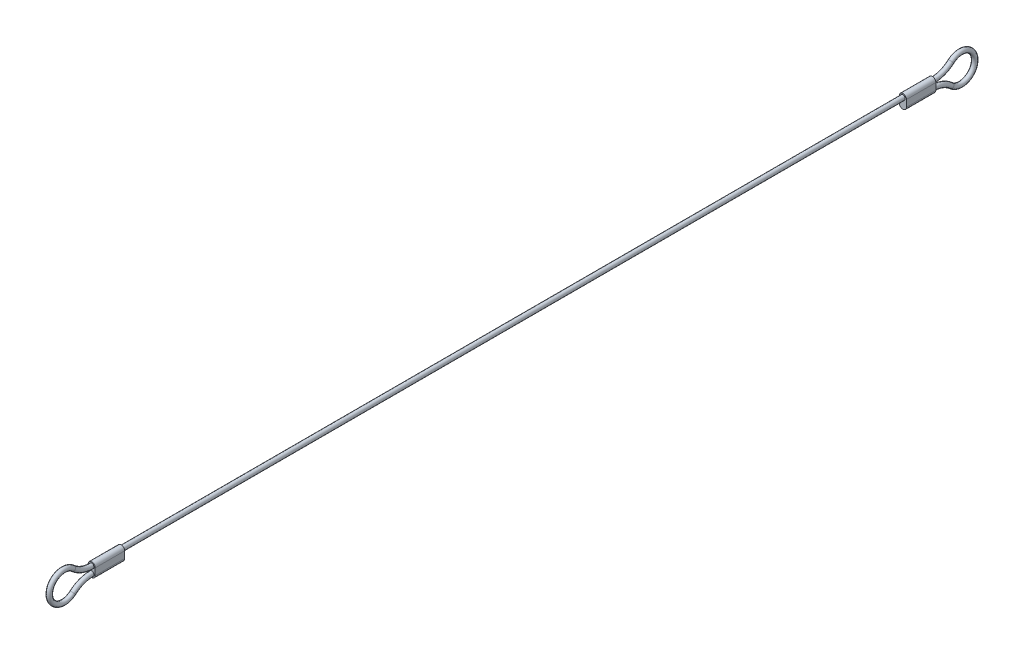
ISO-10303-21;
HEADER;
FILE_DESCRIPTION(('STEP AP214'),'2;1');
FILE_NAME('part.step','',(''),(''),'','','');
FILE_SCHEMA(('AUTOMOTIVE_DESIGN { 1 0 10303 214 1 1 1 1 }'));
ENDSEC;
DATA;
#1=APPLICATION_CONTEXT('core data for automotive mechanical design processes');
#2=APPLICATION_PROTOCOL_DEFINITION('international standard','automotive_design',2000,#1);
#3=PRODUCT_CONTEXT('',#1,'mechanical');
#4=PRODUCT('Part','Part','',(#3));
#5=PRODUCT_RELATED_PRODUCT_CATEGORY('part','',(#4));
#6=PRODUCT_DEFINITION_FORMATION('','',#4);
#7=PRODUCT_DEFINITION_CONTEXT('part definition',#1,'design');
#8=PRODUCT_DEFINITION('design','',#6,#7);
#9=PRODUCT_DEFINITION_SHAPE('','',#8);
#10=(LENGTH_UNIT() NAMED_UNIT(*) SI_UNIT(.MILLI.,.METRE.));
#11=(NAMED_UNIT(*) PLANE_ANGLE_UNIT() SI_UNIT($,.RADIAN.));
#12=(NAMED_UNIT(*) SI_UNIT($,.STERADIAN.) SOLID_ANGLE_UNIT());
#13=UNCERTAINTY_MEASURE_WITH_UNIT(LENGTH_MEASURE(1.E-05),#10,'distance_accuracy_value','');
#14=(GEOMETRIC_REPRESENTATION_CONTEXT(3) GLOBAL_UNCERTAINTY_ASSIGNED_CONTEXT((#13)) GLOBAL_UNIT_ASSIGNED_CONTEXT((#10,
#11,#12)) REPRESENTATION_CONTEXT('',''));
#15=CARTESIAN_POINT('',(0.,0.,0.));
#16=DIRECTION('',(0.,0.,1.));
#17=DIRECTION('',(1.,0.,0.));
#18=AXIS2_PLACEMENT_3D('',#15,#16,#17);
#19=CARTESIAN_POINT('',(0.,0.,-142.8));
#20=DIRECTION('',(0.,0.,1.));
#21=DIRECTION('',(1.,0.,0.));
#22=AXIS2_PLACEMENT_3D('',#19,#20,#21);
#23=CYLINDRICAL_SURFACE('',#22,0.795);
#24=CARTESIAN_POINT('',(0.,0.,-132.8));
#25=DIRECTION('',(0.,0.,1.));
#26=DIRECTION('',(0.,-1.,0.));
#27=AXIS2_PLACEMENT_3D('',#24,#25,#26);
#28=CIRCLE('',#27,0.795);
#29=CARTESIAN_POINT('',(0.,-0.795,-132.8));
#30=VERTEX_POINT('',#29);
#31=EDGE_CURVE('E11',#30,#30,#28,.F.);
#32=ORIENTED_EDGE('',*,*,#31,.F.);
#33=EDGE_LOOP('',(#32));
#34=FACE_BOUND('',#33,.T.);
#35=CARTESIAN_POINT('',(0.,0.,132.8));
#36=DIRECTION('',(0.,0.,-1.));
#37=DIRECTION('',(0.,1.,0.));
#38=AXIS2_PLACEMENT_3D('',#35,#36,#37);
#39=CIRCLE('',#38,0.795);
#40=CARTESIAN_POINT('',(0.,0.795,132.8));
#41=VERTEX_POINT('',#40);
#42=EDGE_CURVE('E51',#41,#41,#39,.F.);
#43=ORIENTED_EDGE('',*,*,#42,.F.);
#44=EDGE_LOOP('',(#43));
#45=FACE_BOUND('',#44,.T.);
#46=ADVANCED_FACE('F41',(#34,#45),#23,.T.);
#47=CARTESIAN_POINT('',(0.,0.,142.8));
#48=DIRECTION('',(0.,0.,-1.));
#49=DIRECTION('',(0.,1.,0.));
#50=AXIS2_PLACEMENT_3D('',#47,#48,#49);
#51=PLANE('',#50);
#52=CARTESIAN_POINT('',(0.,0.,142.8));
#53=DIRECTION('',(0.,0.,-1.));
#54=DIRECTION('',(0.,1.,0.));
#55=AXIS2_PLACEMENT_3D('',#52,#53,#54);
#56=CIRCLE('',#55,1.2);
#57=CARTESIAN_POINT('',(-1.2,0.,142.8));
#58=VERTEX_POINT('',#57);
#59=CARTESIAN_POINT('',(1.2,0.,142.8));
#60=VERTEX_POINT('',#59);
#61=EDGE_CURVE('E186',#58,#60,#56,.T.);
#62=ORIENTED_EDGE('',*,*,#61,.F.);
#63=DIRECTION('',(0.,1.,0.));
#64=VECTOR('',#63,1.);
#65=CARTESIAN_POINT('',(-1.2,0.,142.8));
#66=LINE('',#65,#64);
#67=CARTESIAN_POINT('',(-1.2,-2.26625258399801,142.8));
#68=VERTEX_POINT('',#67);
#69=EDGE_CURVE('E83',#68,#58,#66,.T.);
#70=ORIENTED_EDGE('',*,*,#69,.F.);
#71=CARTESIAN_POINT('',(0.,-2.26625258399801,142.8));
#72=DIRECTION('',(0.,0.,-1.));
#73=DIRECTION('',(0.,1.,0.));
#74=AXIS2_PLACEMENT_3D('',#71,#72,#73);
#75=CIRCLE('',#74,1.2);
#76=CARTESIAN_POINT('',(1.2,-2.26625258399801,142.8));
#77=VERTEX_POINT('',#76);
#78=EDGE_CURVE('E77',#77,#68,#75,.T.);
#79=ORIENTED_EDGE('',*,*,#78,.F.);
#80=DIRECTION('',(0.,-1.,0.));
#81=VECTOR('',#80,1.);
#82=CARTESIAN_POINT('',(1.2,0.,142.8));
#83=LINE('',#82,#81);
#84=EDGE_CURVE('E190',#60,#77,#83,.T.);
#85=ORIENTED_EDGE('',*,*,#84,.F.);
#86=EDGE_LOOP('',(#62,#70,#79,#85));
#87=FACE_BOUND('',#86,.T.);
#88=CARTESIAN_POINT('',(0.,0.,142.8));
#89=DIRECTION('',(0.,0.,-1.));
#90=DIRECTION('',(0.,1.,0.));
#91=AXIS2_PLACEMENT_3D('',#88,#89,#90);
#92=CIRCLE('',#91,0.795);
#93=CARTESIAN_POINT('',(0.,-0.794999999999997,142.8));
#94=VERTEX_POINT('',#93);
#95=EDGE_CURVE('E207',#94,#94,#92,.F.);
#96=ORIENTED_EDGE('',*,*,#95,.F.);
#97=EDGE_LOOP('',(#96));
#98=FACE_BOUND('',#97,.T.);
#99=CARTESIAN_POINT('',(0.,-2.266252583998,142.8));
#100=DIRECTION('',(0.,0.,-1.));
#101=DIRECTION('',(1.,0.,0.));
#102=AXIS2_PLACEMENT_3D('',#99,#100,#101);
#103=CIRCLE('',#102,0.795);
#104=CARTESIAN_POINT('',(0.,-1.471252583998,142.8));
#105=VERTEX_POINT('',#104);
#106=EDGE_CURVE('E233',#105,#105,#103,.T.);
#107=ORIENTED_EDGE('',*,*,#106,.T.);
#108=EDGE_LOOP('',(#107));
#109=FACE_BOUND('',#108,.T.);
#110=ADVANCED_FACE('F243',(#87,#98,#109),#51,.F.);
#111=CARTESIAN_POINT('',(0.,0.,132.8));
#112=DIRECTION('',(0.,0.,1.));
#113=DIRECTION('',(0.,-1.,0.));
#114=AXIS2_PLACEMENT_3D('',#111,#112,#113);
#115=CYLINDRICAL_SURFACE('',#114,1.2);
#116=ORIENTED_EDGE('',*,*,#61,.T.);
#117=DIRECTION('',(0.,0.,1.));
#118=VECTOR('',#117,1.);
#119=CARTESIAN_POINT('',(1.2,0.,132.8));
#120=LINE('',#119,#118);
#121=CARTESIAN_POINT('',(1.2,0.,132.8));
#122=VERTEX_POINT('',#121);
#123=EDGE_CURVE('E204',#122,#60,#120,.T.);
#124=ORIENTED_EDGE('',*,*,#123,.F.);
#125=CARTESIAN_POINT('',(0.,0.,132.8));
#126=DIRECTION('',(0.,0.,-1.));
#127=DIRECTION('',(0.,1.,0.));
#128=AXIS2_PLACEMENT_3D('',#125,#126,#127);
#129=CIRCLE('',#128,1.2);
#130=CARTESIAN_POINT('',(-1.2,0.,132.8));
#131=VERTEX_POINT('',#130);
#132=EDGE_CURVE('E175',#131,#122,#129,.T.);
#133=ORIENTED_EDGE('',*,*,#132,.F.);
#134=DIRECTION('',(0.,0.,1.));
#135=VECTOR('',#134,1.);
#136=CARTESIAN_POINT('',(-1.2,0.,132.8));
#137=LINE('',#136,#135);
#138=EDGE_CURVE('E185',#131,#58,#137,.T.);
#139=ORIENTED_EDGE('',*,*,#138,.T.);
#140=EDGE_LOOP('',(#116,#124,#133,#139));
#141=FACE_BOUND('',#140,.T.);
#142=ADVANCED_FACE('F249',(#141),#115,.T.);
#143=CARTESIAN_POINT('',(1.2,0.,132.8));
#144=DIRECTION('',(-1.,0.,0.));
#145=DIRECTION('',(0.,0.,1.));
#146=AXIS2_PLACEMENT_3D('',#143,#144,#145);
#147=PLANE('',#146);
#148=ORIENTED_EDGE('',*,*,#84,.T.);
#149=DIRECTION('',(0.,0.,1.));
#150=VECTOR('',#149,1.);
#151=CARTESIAN_POINT('',(1.2,-2.26625258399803,132.8));
#152=LINE('',#151,#150);
#153=CARTESIAN_POINT('',(1.2,-2.26625258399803,132.8));
#154=VERTEX_POINT('',#153);
#155=EDGE_CURVE('E201',#154,#77,#152,.T.);
#156=ORIENTED_EDGE('',*,*,#155,.F.);
#157=DIRECTION('',(0.,-1.,0.));
#158=VECTOR('',#157,1.);
#159=CARTESIAN_POINT('',(1.2,0.,132.8));
#160=LINE('',#159,#158);
#161=EDGE_CURVE('E91',#122,#154,#160,.T.);
#162=ORIENTED_EDGE('',*,*,#161,.F.);
#163=ORIENTED_EDGE('',*,*,#123,.T.);
#164=EDGE_LOOP('',(#148,#156,#162,#163));
#165=FACE_BOUND('',#164,.T.);
#166=ADVANCED_FACE('F291',(#165),#147,.F.);
#167=CARTESIAN_POINT('',(0.,-2.26625258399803,132.8));
#168=DIRECTION('',(0.,0.,1.));
#169=DIRECTION('',(0.,-1.,0.));
#170=AXIS2_PLACEMENT_3D('',#167,#168,#169);
#171=CYLINDRICAL_SURFACE('',#170,1.2);
#172=ORIENTED_EDGE('',*,*,#78,.T.);
#173=DIRECTION('',(0.,0.,1.));
#174=VECTOR('',#173,1.);
#175=CARTESIAN_POINT('',(-1.2,-2.26625258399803,132.8));
#176=LINE('',#175,#174);
#177=CARTESIAN_POINT('',(-1.2,-2.26625258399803,132.8));
#178=VERTEX_POINT('',#177);
#179=EDGE_CURVE('E198',#178,#68,#176,.T.);
#180=ORIENTED_EDGE('',*,*,#179,.F.);
#181=CARTESIAN_POINT('',(0.,-2.26625258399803,132.8));
#182=DIRECTION('',(0.,0.,-1.));
#183=DIRECTION('',(0.,1.,0.));
#184=AXIS2_PLACEMENT_3D('',#181,#182,#183);
#185=CIRCLE('',#184,1.2);
#186=EDGE_CURVE('E180',#154,#178,#185,.T.);
#187=ORIENTED_EDGE('',*,*,#186,.F.);
#188=ORIENTED_EDGE('',*,*,#155,.T.);
#189=EDGE_LOOP('',(#172,#180,#187,#188));
#190=FACE_BOUND('',#189,.T.);
#191=ADVANCED_FACE('F284',(#190),#171,.T.);
#192=CARTESIAN_POINT('',(-1.2,0.,132.8));
#193=DIRECTION('',(1.,0.,0.));
#194=DIRECTION('',(0.,1.,0.));
#195=AXIS2_PLACEMENT_3D('',#192,#193,#194);
#196=PLANE('',#195);
#197=ORIENTED_EDGE('',*,*,#69,.T.);
#198=ORIENTED_EDGE('',*,*,#138,.F.);
#199=DIRECTION('',(0.,1.,0.));
#200=VECTOR('',#199,1.);
#201=CARTESIAN_POINT('',(-1.2,0.,132.8));
#202=LINE('',#201,#200);
#203=EDGE_CURVE('E59',#178,#131,#202,.T.);
#204=ORIENTED_EDGE('',*,*,#203,.F.);
#205=ORIENTED_EDGE('',*,*,#179,.T.);
#206=EDGE_LOOP('',(#197,#198,#204,#205));
#207=FACE_BOUND('',#206,.T.);
#208=ADVANCED_FACE('F279',(#207),#196,.F.);
#209=CARTESIAN_POINT('',(0.,0.,132.8));
#210=DIRECTION('',(0.,0.,-1.));
#211=DIRECTION('',(0.,1.,0.));
#212=AXIS2_PLACEMENT_3D('',#209,#210,#211);
#213=PLANE('',#212);
#214=ORIENTED_EDGE('',*,*,#42,.T.);
#215=EDGE_LOOP('',(#214));
#216=FACE_BOUND('',#215,.T.);
#217=ORIENTED_EDGE('',*,*,#132,.T.);
#218=ORIENTED_EDGE('',*,*,#161,.T.);
#219=ORIENTED_EDGE('',*,*,#186,.T.);
#220=ORIENTED_EDGE('',*,*,#203,.T.);
#221=EDGE_LOOP('',(#217,#218,#219,#220));
#222=FACE_BOUND('',#221,.T.);
#223=ADVANCED_FACE('F240',(#216,#222),#213,.T.);
#224=CARTESIAN_POINT('',(0.,-11.866252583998,142.8));
#225=DIRECTION('',(-1.,0.,0.));
#226=DIRECTION('',(0.,0.,1.));
#227=AXIS2_PLACEMENT_3D('',#224,#225,#226);
#228=TOROIDAL_SURFACE('',#227,9.59999999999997,0.795);
#229=CARTESIAN_POINT('',(0.,-4.71083505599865,149.2));
#230=DIRECTION('',(0.,0.666666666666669,-0.745355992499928));
#231=DIRECTION('',(1.,0.,0.));
#232=AXIS2_PLACEMENT_3D('',#229,#230,#231);
#233=CIRCLE('',#232,0.795);
#234=CARTESIAN_POINT('',(0.,-4.1182770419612,149.73));
#235=VERTEX_POINT('',#234);
#236=EDGE_CURVE('E229',#235,#235,#233,.T.);
#237=CARTESIAN_POINT('',(0.,-11.866252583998,142.8));
#238=DIRECTION('',(-1.,0.,0.));
#239=DIRECTION('',(0.,0.,1.));
#240=AXIS2_PLACEMENT_3D('',#237,#238,#239);
#241=CIRCLE('',#240,10.395);
#242=EDGE_CURVE('',#235,#105,#241,.T.);
#243=ORIENTED_EDGE('',*,*,#236,.T.);
#244=ORIENTED_EDGE('',*,*,#106,.F.);
#245=ORIENTED_EDGE('',*,*,#242,.T.);
#246=ORIENTED_EDGE('',*,*,#242,.F.);
#247=EDGE_LOOP('',(#243,#245,#244,#246));
#248=FACE_BOUND('',#247,.T.);
#249=ADVANCED_FACE('F43',(#248),#228,.T.);
#250=CARTESIAN_POINT('',(0.,-1.13312629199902,152.4));
#251=DIRECTION('',(1.,0.,0.));
#252=DIRECTION('',(0.,0.,-1.));
#253=AXIS2_PLACEMENT_3D('',#250,#251,#252);
#254=TOROIDAL_SURFACE('',#253,4.80000000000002,0.795);
#255=ORIENTED_EDGE('',*,*,#236,.F.);
#256=EDGE_LOOP('',(#255));
#257=FACE_BOUND('',#256,.T.);
#258=CARTESIAN_POINT('',(0.,2.4445824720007,149.2));
#259=DIRECTION('',(0.,0.666666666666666,0.745355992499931));
#260=DIRECTION('',(1.,0.,0.));
#261=AXIS2_PLACEMENT_3D('',#258,#259,#260);
#262=CIRCLE('',#261,0.795);
#263=CARTESIAN_POINT('',(0.,1.85202445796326,149.73));
#264=VERTEX_POINT('',#263);
#265=EDGE_CURVE('E225',#264,#264,#262,.T.);
#266=ORIENTED_EDGE('',*,*,#265,.T.);
#267=EDGE_LOOP('',(#266));
#268=FACE_BOUND('',#267,.T.);
#269=ADVANCED_FACE('F259',(#257,#268),#254,.T.);
#270=CARTESIAN_POINT('',(0.,9.59999999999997,142.8));
#271=DIRECTION('',(-1.,0.,0.));
#272=DIRECTION('',(0.,0.,1.));
#273=AXIS2_PLACEMENT_3D('',#270,#271,#272);
#274=TOROIDAL_SURFACE('',#273,9.59999999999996,0.795);
#275=CARTESIAN_POINT('',(0.,9.59999999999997,142.8));
#276=DIRECTION('',(-1.,0.,0.));
#277=DIRECTION('',(0.,0.,1.));
#278=AXIS2_PLACEMENT_3D('',#275,#276,#277);
#279=CIRCLE('',#278,10.395);
#280=EDGE_CURVE('',#94,#264,#279,.T.);
#281=ORIENTED_EDGE('',*,*,#95,.T.);
#282=ORIENTED_EDGE('',*,*,#265,.F.);
#283=ORIENTED_EDGE('',*,*,#280,.T.);
#284=ORIENTED_EDGE('',*,*,#280,.F.);
#285=EDGE_LOOP('',(#281,#283,#282,#284));
#286=FACE_BOUND('',#285,.T.);
#287=ADVANCED_FACE('F257',(#286),#274,.T.);
#288=CARTESIAN_POINT('',(0.,0.,-132.8));
#289=DIRECTION('',(0.,0.,-1.));
#290=DIRECTION('',(0.,1.,0.));
#291=AXIS2_PLACEMENT_3D('',#288,#289,#290);
#292=CYLINDRICAL_SURFACE('',#291,1.2);
#293=CARTESIAN_POINT('',(0.,0.,-142.8));
#294=DIRECTION('',(0.,0.,-1.));
#295=DIRECTION('',(0.,1.,0.));
#296=AXIS2_PLACEMENT_3D('',#293,#294,#295);
#297=CIRCLE('',#296,1.2);
#298=CARTESIAN_POINT('',(-1.2,0.,-142.8));
#299=VERTEX_POINT('',#298);
#300=CARTESIAN_POINT('',(1.2,0.,-142.8));
#301=VERTEX_POINT('',#300);
#302=EDGE_CURVE('E124',#299,#301,#297,.T.);
#303=ORIENTED_EDGE('',*,*,#302,.F.);
#304=DIRECTION('',(0.,0.,-1.));
#305=VECTOR('',#304,1.);
#306=CARTESIAN_POINT('',(-1.2,0.,-132.8));
#307=LINE('',#306,#305);
#308=CARTESIAN_POINT('',(-1.2,0.,-132.8));
#309=VERTEX_POINT('',#308);
#310=EDGE_CURVE('E118',#309,#299,#307,.T.);
#311=ORIENTED_EDGE('',*,*,#310,.F.);
#312=CARTESIAN_POINT('',(0.,0.,-132.8));
#313=DIRECTION('',(0.,0.,-1.));
#314=DIRECTION('',(0.,1.,0.));
#315=AXIS2_PLACEMENT_3D('',#312,#313,#314);
#316=CIRCLE('',#315,1.2);
#317=CARTESIAN_POINT('',(1.2,0.,-132.8));
#318=VERTEX_POINT('',#317);
#319=EDGE_CURVE('E121',#309,#318,#316,.T.);
#320=ORIENTED_EDGE('',*,*,#319,.T.);
#321=DIRECTION('',(0.,0.,-1.));
#322=VECTOR('',#321,1.);
#323=CARTESIAN_POINT('',(1.2,0.,-132.8));
#324=LINE('',#323,#322);
#325=EDGE_CURVE('E155',#318,#301,#324,.T.);
#326=ORIENTED_EDGE('',*,*,#325,.T.);
#327=EDGE_LOOP('',(#303,#311,#320,#326));
#328=FACE_BOUND('',#327,.T.);
#329=ADVANCED_FACE('F120',(#328),#292,.T.);
#330=CARTESIAN_POINT('',(-1.2,0.,-132.8));
#331=DIRECTION('',(-1.,0.,0.));
#332=DIRECTION('',(0.,-1.,0.));
#333=AXIS2_PLACEMENT_3D('',#330,#331,#332);
#334=PLANE('',#333);
#335=DIRECTION('',(0.,1.,0.));
#336=VECTOR('',#335,1.);
#337=CARTESIAN_POINT('',(-1.2,0.,-142.8));
#338=LINE('',#337,#336);
#339=CARTESIAN_POINT('',(-1.2,-2.26625258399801,-142.8));
#340=VERTEX_POINT('',#339);
#341=EDGE_CURVE('E158',#340,#299,#338,.T.);
#342=ORIENTED_EDGE('',*,*,#341,.F.);
#343=DIRECTION('',(0.,0.,-1.));
#344=VECTOR('',#343,1.);
#345=CARTESIAN_POINT('',(-1.2,-2.26625258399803,-132.8));
#346=LINE('',#345,#344);
#347=CARTESIAN_POINT('',(-1.2,-2.26625258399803,-132.8));
#348=VERTEX_POINT('',#347);
#349=EDGE_CURVE('E131',#348,#340,#346,.T.);
#350=ORIENTED_EDGE('',*,*,#349,.F.);
#351=DIRECTION('',(0.,1.,0.));
#352=VECTOR('',#351,1.);
#353=CARTESIAN_POINT('',(-1.2,0.,-132.8));
#354=LINE('',#353,#352);
#355=EDGE_CURVE('E137',#348,#309,#354,.T.);
#356=ORIENTED_EDGE('',*,*,#355,.T.);
#357=ORIENTED_EDGE('',*,*,#310,.T.);
#358=EDGE_LOOP('',(#342,#350,#356,#357));
#359=FACE_BOUND('',#358,.T.);
#360=ADVANCED_FACE('F144',(#359),#334,.T.);
#361=CARTESIAN_POINT('',(0.,-2.26625258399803,-132.8));
#362=DIRECTION('',(0.,0.,-1.));
#363=DIRECTION('',(0.,1.,0.));
#364=AXIS2_PLACEMENT_3D('',#361,#362,#363);
#365=CYLINDRICAL_SURFACE('',#364,1.2);
#366=CARTESIAN_POINT('',(0.,-2.26625258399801,-142.8));
#367=DIRECTION('',(0.,0.,-1.));
#368=DIRECTION('',(0.,1.,0.));
#369=AXIS2_PLACEMENT_3D('',#366,#367,#368);
#370=CIRCLE('',#369,1.2);
#371=CARTESIAN_POINT('',(1.2,-2.26625258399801,-142.8));
#372=VERTEX_POINT('',#371);
#373=EDGE_CURVE('E161',#372,#340,#370,.T.);
#374=ORIENTED_EDGE('',*,*,#373,.F.);
#375=DIRECTION('',(0.,0.,-1.));
#376=VECTOR('',#375,1.);
#377=CARTESIAN_POINT('',(1.2,-2.26625258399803,-132.8));
#378=LINE('',#377,#376);
#379=CARTESIAN_POINT('',(1.2,-2.26625258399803,-132.8));
#380=VERTEX_POINT('',#379);
#381=EDGE_CURVE('E170',#380,#372,#378,.T.);
#382=ORIENTED_EDGE('',*,*,#381,.F.);
#383=CARTESIAN_POINT('',(0.,-2.26625258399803,-132.8));
#384=DIRECTION('',(0.,0.,-1.));
#385=DIRECTION('',(0.,1.,0.));
#386=AXIS2_PLACEMENT_3D('',#383,#384,#385);
#387=CIRCLE('',#386,1.2);
#388=EDGE_CURVE('E146',#380,#348,#387,.T.);
#389=ORIENTED_EDGE('',*,*,#388,.T.);
#390=ORIENTED_EDGE('',*,*,#349,.T.);
#391=EDGE_LOOP('',(#374,#382,#389,#390));
#392=FACE_BOUND('',#391,.T.);
#393=ADVANCED_FACE('F324',(#392),#365,.T.);
#394=CARTESIAN_POINT('',(1.2,0.,-132.8));
#395=DIRECTION('',(1.,0.,0.));
#396=DIRECTION('',(0.,0.,-1.));
#397=AXIS2_PLACEMENT_3D('',#394,#395,#396);
#398=PLANE('',#397);
#399=DIRECTION('',(0.,-1.,0.));
#400=VECTOR('',#399,1.);
#401=CARTESIAN_POINT('',(1.2,0.,-142.8));
#402=LINE('',#401,#400);
#403=EDGE_CURVE('E142',#301,#372,#402,.T.);
#404=ORIENTED_EDGE('',*,*,#403,.F.);
#405=ORIENTED_EDGE('',*,*,#325,.F.);
#406=DIRECTION('',(0.,-1.,0.));
#407=VECTOR('',#406,1.);
#408=CARTESIAN_POINT('',(1.2,0.,-132.8));
#409=LINE('',#408,#407);
#410=EDGE_CURVE('E140',#318,#380,#409,.T.);
#411=ORIENTED_EDGE('',*,*,#410,.T.);
#412=ORIENTED_EDGE('',*,*,#381,.T.);
#413=EDGE_LOOP('',(#404,#405,#411,#412));
#414=FACE_BOUND('',#413,.T.);
#415=ADVANCED_FACE('F321',(#414),#398,.T.);
#416=CARTESIAN_POINT('',(0.,0.,-132.8));
#417=DIRECTION('',(0.,0.,1.));
#418=DIRECTION('',(0.,1.,0.));
#419=AXIS2_PLACEMENT_3D('',#416,#417,#418);
#420=PLANE('',#419);
#421=ORIENTED_EDGE('',*,*,#31,.T.);
#422=EDGE_LOOP('',(#421));
#423=FACE_BOUND('',#422,.T.);
#424=ORIENTED_EDGE('',*,*,#319,.F.);
#425=ORIENTED_EDGE('',*,*,#355,.F.);
#426=ORIENTED_EDGE('',*,*,#388,.F.);
#427=ORIENTED_EDGE('',*,*,#410,.F.);
#428=EDGE_LOOP('',(#424,#425,#426,#427));
#429=FACE_BOUND('',#428,.T.);
#430=ADVANCED_FACE('F135',(#423,#429),#420,.T.);
#431=CARTESIAN_POINT('',(0.,0.,-142.8));
#432=DIRECTION('',(0.,0.,1.));
#433=DIRECTION('',(0.,1.,0.));
#434=AXIS2_PLACEMENT_3D('',#431,#432,#433);
#435=PLANE('',#434);
#436=CARTESIAN_POINT('',(0.,-2.266252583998,-142.8));
#437=DIRECTION('',(0.,0.,-1.));
#438=DIRECTION('',(1.,0.,0.));
#439=AXIS2_PLACEMENT_3D('',#436,#437,#438);
#440=CIRCLE('',#439,0.795);
#441=CARTESIAN_POINT('',(0.,-1.471252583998,-142.8));
#442=VERTEX_POINT('',#441);
#443=EDGE_CURVE('E130',#442,#442,#440,.T.);
#444=ORIENTED_EDGE('',*,*,#443,.F.);
#445=EDGE_LOOP('',(#444));
#446=FACE_BOUND('',#445,.T.);
#447=CARTESIAN_POINT('',(0.,0.,-142.8));
#448=DIRECTION('',(0.,0.,1.));
#449=DIRECTION('',(1.,0.,0.));
#450=AXIS2_PLACEMENT_3D('',#447,#448,#449);
#451=CIRCLE('',#450,0.795);
#452=CARTESIAN_POINT('',(0.,-0.795000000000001,-142.8));
#453=VERTEX_POINT('',#452);
#454=EDGE_CURVE('E221',#453,#453,#451,.T.);
#455=ORIENTED_EDGE('',*,*,#454,.T.);
#456=EDGE_LOOP('',(#455));
#457=FACE_BOUND('',#456,.T.);
#458=ORIENTED_EDGE('',*,*,#302,.T.);
#459=ORIENTED_EDGE('',*,*,#403,.T.);
#460=ORIENTED_EDGE('',*,*,#373,.T.);
#461=ORIENTED_EDGE('',*,*,#341,.T.);
#462=EDGE_LOOP('',(#458,#459,#460,#461));
#463=FACE_BOUND('',#462,.T.);
#464=ADVANCED_FACE('F300',(#446,#457,#463),#435,.F.);
#465=CARTESIAN_POINT('',(0.,-11.866252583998,-142.8));
#466=DIRECTION('',(-1.,0.,0.));
#467=DIRECTION('',(0.,0.,1.));
#468=AXIS2_PLACEMENT_3D('',#465,#466,#467);
#469=TOROIDAL_SURFACE('',#468,9.59999999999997,0.795);
#470=CARTESIAN_POINT('',(0.,-4.71083505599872,-149.2));
#471=DIRECTION('',(0.,-0.666666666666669,-0.745355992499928));
#472=DIRECTION('',(1.,0.,0.));
#473=AXIS2_PLACEMENT_3D('',#470,#471,#472);
#474=CIRCLE('',#473,0.795);
#475=CARTESIAN_POINT('',(0.,-4.11827704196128,-149.73));
#476=VERTEX_POINT('',#475);
#477=EDGE_CURVE('E210',#476,#476,#474,.T.);
#478=CARTESIAN_POINT('',(0.,-11.866252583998,-142.8));
#479=DIRECTION('',(-1.,0.,0.));
#480=DIRECTION('',(0.,0.,1.));
#481=AXIS2_PLACEMENT_3D('',#478,#479,#480);
#482=CIRCLE('',#481,10.395);
#483=EDGE_CURVE('',#442,#476,#482,.T.);
#484=ORIENTED_EDGE('',*,*,#443,.T.);
#485=ORIENTED_EDGE('',*,*,#477,.F.);
#486=ORIENTED_EDGE('',*,*,#483,.T.);
#487=ORIENTED_EDGE('',*,*,#483,.F.);
#488=EDGE_LOOP('',(#484,#486,#485,#487));
#489=FACE_BOUND('',#488,.T.);
#490=ADVANCED_FACE('F297',(#489),#469,.T.);
#491=CARTESIAN_POINT('',(0.,-1.13312629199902,-152.4));
#492=DIRECTION('',(1.,0.,0.));
#493=DIRECTION('',(0.,0.,-1.));
#494=AXIS2_PLACEMENT_3D('',#491,#492,#493);
#495=TOROIDAL_SURFACE('',#494,4.80000000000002,0.795);
#496=CARTESIAN_POINT('',(0.,2.44458247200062,-149.2));
#497=DIRECTION('',(0.,-0.666666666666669,0.745355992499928));
#498=DIRECTION('',(1.,0.,0.));
#499=AXIS2_PLACEMENT_3D('',#496,#497,#498);
#500=CIRCLE('',#499,0.795);
#501=CARTESIAN_POINT('',(0.,1.85202445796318,-149.73));
#502=VERTEX_POINT('',#501);
#503=EDGE_CURVE('E217',#502,#502,#500,.T.);
#504=ORIENTED_EDGE('',*,*,#503,.F.);
#505=EDGE_LOOP('',(#504));
#506=FACE_BOUND('',#505,.T.);
#507=ORIENTED_EDGE('',*,*,#477,.T.);
#508=EDGE_LOOP('',(#507));
#509=FACE_BOUND('',#508,.T.);
#510=ADVANCED_FACE('F299',(#506,#509),#495,.T.);
#511=CARTESIAN_POINT('',(0.,9.59999999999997,-142.8));
#512=DIRECTION('',(-1.,0.,0.));
#513=DIRECTION('',(0.,0.,1.));
#514=AXIS2_PLACEMENT_3D('',#511,#512,#513);
#515=TOROIDAL_SURFACE('',#514,9.59999999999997,0.795);
#516=CARTESIAN_POINT('',(0.,9.59999999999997,-142.8));
#517=DIRECTION('',(-1.,0.,0.));
#518=DIRECTION('',(0.,0.,1.));
#519=AXIS2_PLACEMENT_3D('',#516,#517,#518);
#520=CIRCLE('',#519,10.395);
#521=EDGE_CURVE('',#502,#453,#520,.T.);
#522=ORIENTED_EDGE('',*,*,#503,.T.);
#523=ORIENTED_EDGE('',*,*,#454,.F.);
#524=ORIENTED_EDGE('',*,*,#521,.T.);
#525=ORIENTED_EDGE('',*,*,#521,.F.);
#526=EDGE_LOOP('',(#522,#524,#523,#525));
#527=FACE_BOUND('',#526,.T.);
#528=ADVANCED_FACE('F255',(#527),#515,.T.);
#529=CLOSED_SHELL('',(#46,#110,#142,#166,#191,#208,#223,#249,#269,#287,#329,#360,#393,#415,#430,
#464,#490,#510,#528));
#530=MANIFOLD_SOLID_BREP('B2',#529);
#531=ADVANCED_BREP_SHAPE_REPRESENTATION('',(#18,#530),#14);
#532=SHAPE_DEFINITION_REPRESENTATION(#9,#531);
ENDSEC;
END-ISO-10303-21;
